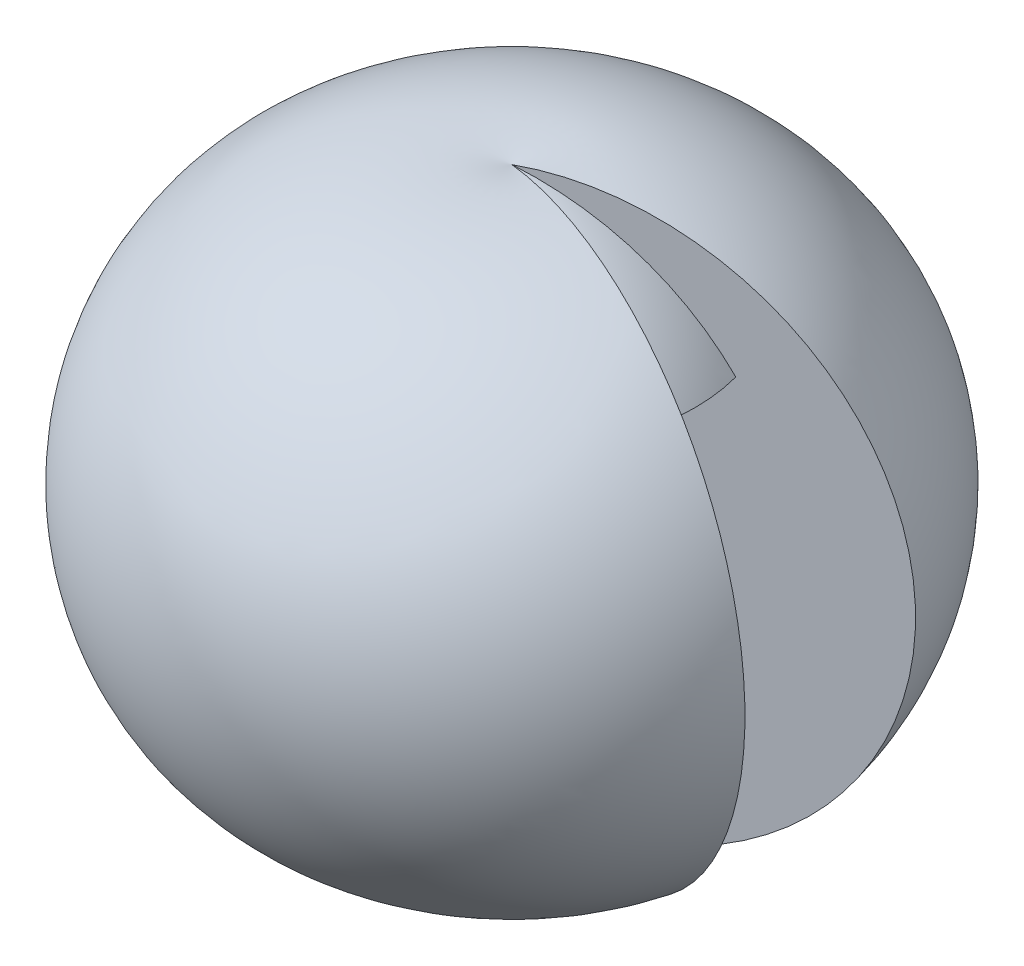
ISO-10303-21;
HEADER;
FILE_DESCRIPTION(('STEP AP214'),'2;1');
FILE_NAME('part.step','',(''),(''),'','','');
FILE_SCHEMA(('AUTOMOTIVE_DESIGN { 1 0 10303 214 1 1 1 1 }'));
ENDSEC;
DATA;
#1=APPLICATION_CONTEXT('core data for automotive mechanical design processes');
#2=APPLICATION_PROTOCOL_DEFINITION('international standard','automotive_design',2000,#1);
#3=PRODUCT_CONTEXT('',#1,'mechanical');
#4=PRODUCT('Part','Part','',(#3));
#5=PRODUCT_RELATED_PRODUCT_CATEGORY('part','',(#4));
#6=PRODUCT_DEFINITION_FORMATION('','',#4);
#7=PRODUCT_DEFINITION_CONTEXT('part definition',#1,'design');
#8=PRODUCT_DEFINITION('design','',#6,#7);
#9=PRODUCT_DEFINITION_SHAPE('','',#8);
#10=(LENGTH_UNIT() NAMED_UNIT(*) SI_UNIT(.MILLI.,.METRE.));
#11=(NAMED_UNIT(*) PLANE_ANGLE_UNIT() SI_UNIT($,.RADIAN.));
#12=(NAMED_UNIT(*) SI_UNIT($,.STERADIAN.) SOLID_ANGLE_UNIT());
#13=UNCERTAINTY_MEASURE_WITH_UNIT(LENGTH_MEASURE(1.E-05),#10,'distance_accuracy_value','');
#14=(GEOMETRIC_REPRESENTATION_CONTEXT(3) GLOBAL_UNCERTAINTY_ASSIGNED_CONTEXT((#13)) GLOBAL_UNIT_ASSIGNED_CONTEXT((#10,
#11,#12)) REPRESENTATION_CONTEXT('',''));
#15=CARTESIAN_POINT('',(0.,0.,0.));
#16=DIRECTION('',(0.,0.,1.));
#17=DIRECTION('',(1.,0.,0.));
#18=AXIS2_PLACEMENT_3D('',#15,#16,#17);
#19=CARTESIAN_POINT('',(0.,618.910362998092,255.119580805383));
#20=DIRECTION('',(-1.,0.,0.));
#21=DIRECTION('',(0.,0.,-1.));
#22=AXIS2_PLACEMENT_3D('',#19,#20,#21);
#23=CIRCLE('',#22,412.993946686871);
#24=TRIMMED_CURVE('',#23,(PARAMETER_VALUE(-0.904940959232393)),
(PARAMETER_VALUE(0.904940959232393)),.T.,.PARAMETER.);
#25=CARTESIAN_POINT('',(0.,618.910362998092,0.));
#26=DIRECTION('',(0.,-1.,0.));
#27=AXIS1_PLACEMENT('',#25,#26);
#28=SURFACE_OF_REVOLUTION('',#24,#27);
#29=CARTESIAN_POINT('',(-246.426591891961,618.910362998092,66.0298062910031));
#30=DIRECTION('',(0.258819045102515,0.,0.96592582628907));
#31=DIRECTION('',(-0.96592582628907,0.,0.258819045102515));
#32=AXIS2_PLACEMENT_3D('',#29,#30,#31);
#33=CIRCLE('',#32,412.993946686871);
#34=CARTESIAN_POINT('',(148.268958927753,678.865285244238,-39.7285478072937));
#35=VERTEX_POINT('',#34);
#36=CARTESIAN_POINT('',(0.,943.684129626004,0.));
#37=VERTEX_POINT('',#36);
#38=EDGE_CURVE('E132',#35,#37,#33,.T.);
#39=ORIENTED_EDGE('',*,*,#38,.T.);
#40=CARTESIAN_POINT('',(-246.426591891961,618.910362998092,-66.0298062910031));
#41=DIRECTION('',(-0.258819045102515,0.,0.96592582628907));
#42=DIRECTION('',(-0.96592582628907,0.,-0.258819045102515));
#43=AXIS2_PLACEMENT_3D('',#40,#41,#42);
#44=CIRCLE('',#43,412.993946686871);
#45=CARTESIAN_POINT('',(148.268958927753,678.865285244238,39.7285478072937));
#46=VERTEX_POINT('',#45);
#47=EDGE_CURVE('E148',#46,#37,#44,.T.);
#48=ORIENTED_EDGE('',*,*,#47,.F.);
#49=CARTESIAN_POINT('',(0.,678.865285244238,0.));
#50=DIRECTION('',(0.,-1.,0.));
#51=DIRECTION('',(0.,0.,-1.));
#52=AXIS2_PLACEMENT_3D('',#49,#50,#51);
#53=CIRCLE('',#52,153.499321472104);
#54=EDGE_CURVE('E43',#46,#35,#53,.T.);
#55=ORIENTED_EDGE('',*,*,#54,.T.);
#56=EDGE_LOOP('',(#39,#48,#55));
#57=FACE_BOUND('',#56,.T.);
#58=ADVANCED_FACE('F16',(#57),#28,.F.);
#59=CARTESIAN_POINT('',(0.,430.,-150.000000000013));
#60=DIRECTION('',(-1.,0.,0.));
#61=DIRECTION('',(0.,0.,-1.));
#62=AXIS2_PLACEMENT_3D('',#59,#60,#61);
#63=CIRCLE('',#62,848.643717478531);
#64=TRIMMED_CURVE('',#63,(PARAMETER_VALUE(-1.74848246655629)),
(PARAMETER_VALUE(1.74848246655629)),.T.,.PARAMETER.);
#65=CARTESIAN_POINT('',(0.,430.,0.));
#66=DIRECTION('',(0.,-1.,0.));
#67=AXIS1_PLACEMENT('',#65,#66);
#68=SURFACE_OF_REVOLUTION('',#64,#67);
#69=CARTESIAN_POINT('',(0.,-362.034461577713,0.));
#70=DIRECTION('',(0.,-1.,0.));
#71=DIRECTION('',(0.,0.,-1.));
#72=AXIS2_PLACEMENT_3D('',#69,#70,#71);
#73=CIRCLE('',#72,454.758217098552);
#74=CARTESIAN_POINT('',(439.262706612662,-362.034461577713,117.700087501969));
#75=VERTEX_POINT('',#74);
#76=CARTESIAN_POINT('',(439.262706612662,-362.034461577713,-117.700087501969));
#77=VERTEX_POINT('',#76);
#78=EDGE_CURVE('E170',#75,#77,#73,.T.);
#79=ORIENTED_EDGE('',*,*,#78,.F.);
#80=CARTESIAN_POINT('',(144.888873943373,430.,38.8228567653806));
#81=DIRECTION('',(0.258819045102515,0.,-0.96592582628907));
#82=DIRECTION('',(-0.96592582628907,0.,-0.258819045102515));
#83=AXIS2_PLACEMENT_3D('',#80,#81,#82);
#84=CIRCLE('',#83,848.643717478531);
#85=CARTESIAN_POINT('',(0.,1265.28208361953,0.));
#86=VERTEX_POINT('',#85);
#87=EDGE_CURVE('E152',#86,#75,#84,.T.);
#88=ORIENTED_EDGE('',*,*,#87,.F.);
#89=CARTESIAN_POINT('',(144.888873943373,430.,-38.8228567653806));
#90=DIRECTION('',(-0.258819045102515,0.,-0.96592582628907));
#91=DIRECTION('',(-0.96592582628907,0.,0.258819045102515));
#92=AXIS2_PLACEMENT_3D('',#89,#90,#91);
#93=CIRCLE('',#92,848.643717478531);
#94=EDGE_CURVE('E136',#86,#77,#93,.T.);
#95=ORIENTED_EDGE('',*,*,#94,.T.);
#96=EDGE_LOOP('',(#79,#88,#95));
#97=FACE_BOUND('',#96,.T.);
#98=ADVANCED_FACE('F18',(#97),#68,.T.);
#99=CARTESIAN_POINT('',(0.,-39.1466122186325,-330.517757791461));
#100=DIRECTION('',(-1.,0.,0.));
#101=DIRECTION('',(0.,0.,-1.));
#102=AXIS2_PLACEMENT_3D('',#99,#100,#101);
#103=CIRCLE('',#102,345.9656847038);
#104=TRIMMED_CURVE('',#103,(PARAMETER_VALUE(-2.84163290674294)),
(PARAMETER_VALUE(2.84163290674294)),.T.,.PARAMETER.);
#105=CARTESIAN_POINT('',(0.,-39.1466122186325,0.));
#106=DIRECTION('',(0.,-1.,0.));
#107=AXIS1_PLACEMENT('',#105,#106);
#108=SURFACE_OF_REVOLUTION('',#104,#107);
#109=CARTESIAN_POINT('',(319.255638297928,-39.1466122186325,-85.5442904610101));
#110=DIRECTION('',(-0.258819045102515,0.,-0.96592582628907));
#111=DIRECTION('',(-0.96592582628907,0.,0.258819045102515));
#112=AXIS2_PLACEMENT_3D('',#109,#110,#111);
#113=CIRCLE('',#112,345.9656847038);
#114=CARTESIAN_POINT('',(0.,-141.373158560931,0.));
#115=VERTEX_POINT('',#114);
#116=EDGE_CURVE('E140',#77,#115,#113,.T.);
#117=ORIENTED_EDGE('',*,*,#116,.T.);
#118=CARTESIAN_POINT('',(319.255638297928,-39.1466122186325,85.5442904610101));
#119=DIRECTION('',(0.258819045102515,0.,-0.96592582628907));
#120=DIRECTION('',(-0.96592582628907,0.,-0.258819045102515));
#121=AXIS2_PLACEMENT_3D('',#118,#119,#120);
#122=CIRCLE('',#121,345.9656847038);
#123=EDGE_CURVE('E156',#75,#115,#122,.T.);
#124=ORIENTED_EDGE('',*,*,#123,.F.);
#125=ORIENTED_EDGE('',*,*,#78,.T.);
#126=EDGE_LOOP('',(#117,#124,#125));
#127=FACE_BOUND('',#126,.T.);
#128=ADVANCED_FACE('F219',(#127),#108,.T.);
#129=CARTESIAN_POINT('',(0.,96.6929621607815,-123.496947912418));
#130=DIRECTION('',(-1.,0.,0.));
#131=DIRECTION('',(0.,0.,-1.));
#132=AXIS2_PLACEMENT_3D('',#129,#130,#131);
#133=CIRCLE('',#132,252.947213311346);
#134=TRIMMED_CURVE('',#133,(PARAMETER_VALUE(-2.08085917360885)),
(PARAMETER_VALUE(2.08085917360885)),.T.,.PARAMETER.);
#135=CARTESIAN_POINT('',(0.,96.6929621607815,0.));
#136=DIRECTION('',(0.,-1.,0.));
#137=AXIS1_PLACEMENT('',#135,#136);
#138=SURFACE_OF_REVOLUTION('',#134,#137);
#139=CARTESIAN_POINT('',(-119.288891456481,96.6929621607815,-31.9633621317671));
#140=DIRECTION('',(0.258819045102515,0.,-0.96592582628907));
#141=DIRECTION('',(-0.96592582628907,0.,-0.258819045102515));
#142=AXIS2_PLACEMENT_3D('',#139,#140,#141);
#143=CIRCLE('',#142,252.947213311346);
#144=CARTESIAN_POINT('',(-4.12137128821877,-126.391000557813,-1.104318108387));
#145=VERTEX_POINT('',#144);
#146=CARTESIAN_POINT('',(0.,-124.05756802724,0.));
#147=VERTEX_POINT('',#146);
#148=EDGE_CURVE('E110',#145,#147,#143,.F.);
#149=ORIENTED_EDGE('',*,*,#148,.F.);
#150=CARTESIAN_POINT('',(-1.82327538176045E-13,-126.391000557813,0.));
#151=DIRECTION('',(0.,-1.,0.));
#152=DIRECTION('',(1.,0.,0.));
#153=AXIS2_PLACEMENT_3D('',#150,#151,#152);
#154=CIRCLE('',#153,4.26675752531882);
#155=CARTESIAN_POINT('',(4.12137128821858,-126.391000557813,-1.10431810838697));
#156=VERTEX_POINT('',#155);
#157=EDGE_CURVE('E123',#145,#156,#154,.T.);
#158=ORIENTED_EDGE('',*,*,#157,.T.);
#159=CARTESIAN_POINT('',(119.288891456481,96.6929621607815,-31.9633621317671));
#160=DIRECTION('',(0.258819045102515,0.,0.96592582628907));
#161=DIRECTION('',(-0.96592582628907,0.,0.258819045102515));
#162=AXIS2_PLACEMENT_3D('',#159,#160,#161);
#163=CIRCLE('',#162,252.947213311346);
#164=CARTESIAN_POINT('',(312.476943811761,251.551275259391,-83.7279447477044));
#165=VERTEX_POINT('',#164);
#166=EDGE_CURVE('E143',#156,#165,#163,.T.);
#167=ORIENTED_EDGE('',*,*,#166,.T.);
#168=CARTESIAN_POINT('',(0.,251.551275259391,0.));
#169=DIRECTION('',(0.,-1.,0.));
#170=DIRECTION('',(0.,0.,-1.));
#171=AXIS2_PLACEMENT_3D('',#168,#169,#170);
#172=CIRCLE('',#171,323.499936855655);
#173=CARTESIAN_POINT('',(312.476943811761,251.551275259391,83.7279447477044));
#174=VERTEX_POINT('',#173);
#175=EDGE_CURVE('E167',#174,#165,#172,.T.);
#176=ORIENTED_EDGE('',*,*,#175,.F.);
#177=CARTESIAN_POINT('',(119.288891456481,96.6929621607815,31.9633621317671));
#178=DIRECTION('',(-0.258819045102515,0.,0.96592582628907));
#179=DIRECTION('',(-0.96592582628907,0.,-0.258819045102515));
#180=AXIS2_PLACEMENT_3D('',#177,#178,#179);
#181=CIRCLE('',#180,252.947213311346);
#182=CARTESIAN_POINT('',(4.1213712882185,-126.391000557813,1.10431810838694));
#183=VERTEX_POINT('',#182);
#184=EDGE_CURVE('E159',#183,#174,#181,.T.);
#185=ORIENTED_EDGE('',*,*,#184,.F.);
#186=CARTESIAN_POINT('',(-4.12137128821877,-126.391000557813,1.10431810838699));
#187=VERTEX_POINT('',#186);
#188=EDGE_CURVE('E121',#183,#187,#154,.T.);
#189=ORIENTED_EDGE('',*,*,#188,.T.);
#190=CARTESIAN_POINT('',(-119.288891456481,96.6929621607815,31.9633621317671));
#191=DIRECTION('',(-0.258819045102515,0.,-0.96592582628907));
#192=DIRECTION('',(-0.96592582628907,0.,0.258819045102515));
#193=AXIS2_PLACEMENT_3D('',#190,#191,#192);
#194=CIRCLE('',#193,252.947213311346);
#195=EDGE_CURVE('E99',#187,#147,#194,.F.);
#196=ORIENTED_EDGE('',*,*,#195,.T.);
#197=EDGE_LOOP('',(#149,#158,#167,#176,#185,#189,#196));
#198=FACE_BOUND('',#197,.T.);
#199=ADVANCED_FACE('F198',(#198),#138,.F.);
#200=CARTESIAN_POINT('',(0.,430.,0.));
#201=DIRECTION('',(0.,-1.,0.));
#202=DIRECTION('',(0.,0.,-1.));
#203=AXIS2_PLACEMENT_3D('',#200,#201,#202);
#204=DEGENERATE_TOROIDAL_SURFACE('',#203,150.000000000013,248.889886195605,.T.);
#205=CARTESIAN_POINT('',(144.888873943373,430.,38.8228567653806));
#206=DIRECTION('',(-0.258819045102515,0.,0.96592582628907));
#207=DIRECTION('',(-0.96592582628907,0.,-0.258819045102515));
#208=AXIS2_PLACEMENT_3D('',#205,#206,#207);
#209=CIRCLE('',#208,248.889886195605);
#210=EDGE_CURVE('E161',#174,#46,#209,.T.);
#211=ORIENTED_EDGE('',*,*,#210,.F.);
#212=ORIENTED_EDGE('',*,*,#175,.T.);
#213=CARTESIAN_POINT('',(144.888873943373,430.,-38.8228567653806));
#214=DIRECTION('',(0.258819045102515,0.,0.96592582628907));
#215=DIRECTION('',(-0.96592582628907,0.,0.258819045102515));
#216=AXIS2_PLACEMENT_3D('',#213,#214,#215);
#217=CIRCLE('',#216,248.889886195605);
#218=EDGE_CURVE('E145',#165,#35,#217,.T.);
#219=ORIENTED_EDGE('',*,*,#218,.T.);
#220=ORIENTED_EDGE('',*,*,#54,.F.);
#221=EDGE_LOOP('',(#211,#212,#219,#220));
#222=FACE_BOUND('',#221,.T.);
#223=ADVANCED_FACE('F193',(#222),#204,.F.);
#224=CARTESIAN_POINT('',(-246.426591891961,618.910362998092,-66.0298062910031));
#225=DIRECTION('',(0.258819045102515,0.,-0.96592582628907));
#226=DIRECTION('',(-0.96592582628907,0.,-0.258819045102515));
#227=AXIS2_PLACEMENT_3D('',#224,#225,#226);
#228=PLANE('',#227);
#229=CARTESIAN_POINT('',(-319.255638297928,-39.1466122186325,-85.5442904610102));
#230=DIRECTION('',(0.258819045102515,0.,-0.96592582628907));
#231=DIRECTION('',(-0.96592582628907,0.,-0.258819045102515));
#232=AXIS2_PLACEMENT_3D('',#229,#230,#231);
#233=CIRCLE('',#232,345.9656847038);
#234=EDGE_CURVE('E119',#183,#115,#233,.T.);
#235=ORIENTED_EDGE('',*,*,#234,.F.);
#236=ORIENTED_EDGE('',*,*,#184,.T.);
#237=ORIENTED_EDGE('',*,*,#210,.T.);
#238=ORIENTED_EDGE('',*,*,#47,.T.);
#239=CARTESIAN_POINT('',(246.42659189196,618.910362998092,66.0298062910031));
#240=DIRECTION('',(0.258819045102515,0.,-0.96592582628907));
#241=DIRECTION('',(-0.96592582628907,0.,-0.258819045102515));
#242=AXIS2_PLACEMENT_3D('',#239,#240,#241);
#243=CIRCLE('',#242,412.993946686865);
#244=CARTESIAN_POINT('',(535.060721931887,903.994516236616,143.369088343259));
#245=VERTEX_POINT('',#244);
#246=EDGE_CURVE('E130',#245,#37,#243,.F.);
#247=ORIENTED_EDGE('',*,*,#246,.F.);
#248=CARTESIAN_POINT('',(-144.888873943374,430.,-38.8228567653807));
#249=DIRECTION('',(0.258819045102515,0.,-0.96592582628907));
#250=DIRECTION('',(-0.96592582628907,0.,-0.258819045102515));
#251=AXIS2_PLACEMENT_3D('',#248,#249,#250);
#252=CIRCLE('',#251,848.643717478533);
#253=EDGE_CURVE('E127',#86,#245,#252,.T.);
#254=ORIENTED_EDGE('',*,*,#253,.F.);
#255=ORIENTED_EDGE('',*,*,#87,.T.);
#256=ORIENTED_EDGE('',*,*,#123,.T.);
#257=EDGE_LOOP('',(#235,#236,#237,#238,#247,#254,#255,#256));
#258=FACE_BOUND('',#257,.T.);
#259=ADVANCED_FACE('F189',(#258),#228,.T.);
#260=CARTESIAN_POINT('',(-246.426591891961,618.910362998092,66.0298062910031));
#261=DIRECTION('',(-0.258819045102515,0.,-0.96592582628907));
#262=DIRECTION('',(-0.96592582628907,0.,0.258819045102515));
#263=AXIS2_PLACEMENT_3D('',#260,#261,#262);
#264=PLANE('',#263);
#265=ORIENTED_EDGE('',*,*,#166,.F.);
#266=CARTESIAN_POINT('',(-319.255638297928,-39.1466122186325,85.5442904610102));
#267=DIRECTION('',(-0.258819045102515,0.,-0.96592582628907));
#268=DIRECTION('',(-0.96592582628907,0.,0.258819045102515));
#269=AXIS2_PLACEMENT_3D('',#266,#267,#268);
#270=CIRCLE('',#269,345.9656847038);
#271=EDGE_CURVE('E11',#156,#115,#270,.T.);
#272=ORIENTED_EDGE('',*,*,#271,.T.);
#273=ORIENTED_EDGE('',*,*,#116,.F.);
#274=ORIENTED_EDGE('',*,*,#94,.F.);
#275=CARTESIAN_POINT('',(-144.888873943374,430.,38.8228567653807));
#276=DIRECTION('',(-0.258819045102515,0.,-0.96592582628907));
#277=DIRECTION('',(-0.96592582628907,0.,0.258819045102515));
#278=AXIS2_PLACEMENT_3D('',#275,#276,#277);
#279=CIRCLE('',#278,848.643717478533);
#280=CARTESIAN_POINT('',(535.060721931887,903.994516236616,-143.369088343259));
#281=VERTEX_POINT('',#280);
#282=EDGE_CURVE('E172',#86,#281,#279,.T.);
#283=ORIENTED_EDGE('',*,*,#282,.T.);
#284=CARTESIAN_POINT('',(246.42659189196,618.910362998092,-66.029806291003));
#285=DIRECTION('',(-0.258819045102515,0.,-0.96592582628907));
#286=DIRECTION('',(-0.96592582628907,0.,0.258819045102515));
#287=AXIS2_PLACEMENT_3D('',#284,#285,#286);
#288=CIRCLE('',#287,412.993946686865);
#289=EDGE_CURVE('E24',#281,#37,#288,.F.);
#290=ORIENTED_EDGE('',*,*,#289,.T.);
#291=ORIENTED_EDGE('',*,*,#38,.F.);
#292=ORIENTED_EDGE('',*,*,#218,.F.);
#293=EDGE_LOOP('',(#265,#272,#273,#274,#283,#290,#291,#292));
#294=FACE_BOUND('',#293,.T.);
#295=ADVANCED_FACE('F181',(#294),#264,.F.);
#296=CARTESIAN_POINT('',(255.119580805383,618.910362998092,0.));
#297=DIRECTION('',(0.,0.,-1.));
#298=DIRECTION('',(1.,0.,0.));
#299=AXIS2_PLACEMENT_3D('',#296,#297,#298);
#300=CIRCLE('',#299,412.993946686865);
#301=TRIMMED_CURVE('',#300,(PARAMETER_VALUE(-2.23665169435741)),
(PARAMETER_VALUE(2.23665169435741)),.T.,.PARAMETER.);
#302=CARTESIAN_POINT('',(-1.11022302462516E-13,618.910362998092,0.));
#303=DIRECTION('',(0.,-1.,0.));
#304=AXIS1_PLACEMENT('',#302,#303);
#305=SURFACE_OF_REVOLUTION('',#301,#304);
#306=CARTESIAN_POINT('',(-1.38596748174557E-13,903.994516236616,0.));
#307=DIRECTION('',(0.,-1.,0.));
#308=DIRECTION('',(1.,0.,0.));
#309=AXIS2_PLACEMENT_3D('',#306,#307,#308);
#310=CIRCLE('',#309,553.935620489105);
#311=EDGE_CURVE('E34',#281,#245,#310,.T.);
#312=ORIENTED_EDGE('',*,*,#311,.T.);
#313=ORIENTED_EDGE('',*,*,#246,.T.);
#314=ORIENTED_EDGE('',*,*,#289,.F.);
#315=EDGE_LOOP('',(#312,#313,#314));
#316=FACE_BOUND('',#315,.T.);
#317=ADVANCED_FACE('F235',(#316),#305,.F.);
#318=CARTESIAN_POINT('',(-150.000000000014,430.,0.));
#319=DIRECTION('',(0.,0.,-1.));
#320=DIRECTION('',(1.,0.,0.));
#321=AXIS2_PLACEMENT_3D('',#318,#319,#320);
#322=CIRCLE('',#321,848.643717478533);
#323=TRIMMED_CURVE('',#322,(PARAMETER_VALUE(-1.3931101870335)),
(PARAMETER_VALUE(1.3931101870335)),.T.,.PARAMETER.);
#324=CARTESIAN_POINT('',(-1.11022302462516E-13,430.,0.));
#325=DIRECTION('',(0.,-1.,0.));
#326=AXIS1_PLACEMENT('',#324,#325);
#327=SURFACE_OF_REVOLUTION('',#323,#326);
#328=ORIENTED_EDGE('',*,*,#282,.F.);
#329=ORIENTED_EDGE('',*,*,#253,.T.);
#330=ORIENTED_EDGE('',*,*,#311,.F.);
#331=EDGE_LOOP('',(#328,#329,#330));
#332=FACE_BOUND('',#331,.T.);
#333=ADVANCED_FACE('F234',(#332),#327,.T.);
#334=CARTESIAN_POINT('',(319.255638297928,-39.1466122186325,-85.5442904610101));
#335=DIRECTION('',(-0.258819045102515,0.,-0.96592582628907));
#336=DIRECTION('',(-0.96592582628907,0.,0.258819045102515));
#337=AXIS2_PLACEMENT_3D('',#334,#335,#336);
#338=PLANE('',#337);
#339=ORIENTED_EDGE('',*,*,#195,.F.);
#340=CARTESIAN_POINT('',(319.255638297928,-39.1466122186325,-85.5442904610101));
#341=DIRECTION('',(-0.258819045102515,0.,-0.96592582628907));
#342=DIRECTION('',(-0.96592582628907,0.,0.258819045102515));
#343=AXIS2_PLACEMENT_3D('',#340,#341,#342);
#344=CIRCLE('',#343,345.9656847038);
#345=CARTESIAN_POINT('',(-5.48459937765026,-120.783717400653,1.46959397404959));
#346=VERTEX_POINT('',#345);
#347=EDGE_CURVE('E92',#187,#346,#344,.T.);
#348=ORIENTED_EDGE('',*,*,#347,.T.);
#349=CARTESIAN_POINT('',(119.288891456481,96.6929621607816,-31.9633621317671));
#350=DIRECTION('',(0.258819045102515,0.,0.96592582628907));
#351=DIRECTION('',(-0.96592582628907,0.,0.258819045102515));
#352=AXIS2_PLACEMENT_3D('',#349,#350,#351);
#353=CIRCLE('',#352,252.947213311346);
#354=EDGE_CURVE('E96',#346,#147,#353,.T.);
#355=ORIENTED_EDGE('',*,*,#354,.T.);
#356=EDGE_LOOP('',(#339,#348,#355));
#357=FACE_BOUND('',#356,.T.);
#358=ADVANCED_FACE('F94',(#357),#338,.T.);
#359=CARTESIAN_POINT('',(-330.517757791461,-39.1466122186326,0.));
#360=DIRECTION('',(0.,0.,-1.));
#361=DIRECTION('',(1.,0.,0.));
#362=AXIS2_PLACEMENT_3D('',#359,#360,#361);
#363=CIRCLE('',#362,345.9656847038);
#364=TRIMMED_CURVE('',#363,(PARAMETER_VALUE(-0.299959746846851)),
(PARAMETER_VALUE(0.299959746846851)),.T.,.PARAMETER.);
#365=CARTESIAN_POINT('',(-1.11022302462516E-13,-39.1466122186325,0.));
#366=DIRECTION('',(0.,-1.,0.));
#367=AXIS1_PLACEMENT('',#365,#366);
#368=SURFACE_OF_REVOLUTION('',#364,#367);
#369=ORIENTED_EDGE('',*,*,#157,.F.);
#370=CARTESIAN_POINT('',(319.255638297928,-39.1466122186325,85.5442904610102));
#371=DIRECTION('',(0.258819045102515,0.,-0.96592582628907));
#372=DIRECTION('',(-0.96592582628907,0.,-0.258819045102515));
#373=AXIS2_PLACEMENT_3D('',#370,#371,#372);
#374=CIRCLE('',#373,345.9656847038);
#375=CARTESIAN_POINT('',(-5.48459937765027,-120.783717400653,-1.46959397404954));
#376=VERTEX_POINT('',#375);
#377=EDGE_CURVE('E107',#145,#376,#374,.T.);
#378=ORIENTED_EDGE('',*,*,#377,.T.);
#379=CARTESIAN_POINT('',(0.,-120.783717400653,0.));
#380=DIRECTION('',(0.,-1.,0.));
#381=DIRECTION('',(1.,0.,0.));
#382=AXIS2_PLACEMENT_3D('',#379,#380,#381);
#383=CIRCLE('',#382,5.67807509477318);
#384=EDGE_CURVE('E104',#376,#346,#383,.T.);
#385=ORIENTED_EDGE('',*,*,#384,.T.);
#386=ORIENTED_EDGE('',*,*,#347,.F.);
#387=ORIENTED_EDGE('',*,*,#188,.F.);
#388=ORIENTED_EDGE('',*,*,#234,.T.);
#389=ORIENTED_EDGE('',*,*,#271,.F.);
#390=EDGE_LOOP('',(#369,#378,#385,#386,#387,#388,#389));
#391=FACE_BOUND('',#390,.T.);
#392=ADVANCED_FACE('F105',(#391),#368,.T.);
#393=CARTESIAN_POINT('',(319.255638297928,-39.1466122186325,85.5442904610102));
#394=DIRECTION('',(0.258819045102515,0.,-0.96592582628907));
#395=DIRECTION('',(-0.96592582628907,0.,-0.258819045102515));
#396=AXIS2_PLACEMENT_3D('',#393,#394,#395);
#397=PLANE('',#396);
#398=ORIENTED_EDGE('',*,*,#377,.F.);
#399=ORIENTED_EDGE('',*,*,#148,.T.);
#400=CARTESIAN_POINT('',(119.288891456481,96.6929621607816,31.9633621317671));
#401=DIRECTION('',(-0.258819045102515,0.,0.96592582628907));
#402=DIRECTION('',(-0.96592582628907,0.,-0.258819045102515));
#403=AXIS2_PLACEMENT_3D('',#400,#401,#402);
#404=CIRCLE('',#403,252.947213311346);
#405=EDGE_CURVE('E111',#376,#147,#404,.T.);
#406=ORIENTED_EDGE('',*,*,#405,.F.);
#407=EDGE_LOOP('',(#398,#399,#406));
#408=FACE_BOUND('',#407,.T.);
#409=ADVANCED_FACE('F200',(#408),#397,.F.);
#410=CARTESIAN_POINT('',(-123.496947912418,96.6929621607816,0.));
#411=DIRECTION('',(0.,0.,-1.));
#412=DIRECTION('',(1.,0.,0.));
#413=AXIS2_PLACEMENT_3D('',#410,#411,#412);
#414=CIRCLE('',#413,252.947213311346);
#415=TRIMMED_CURVE('',#414,(PARAMETER_VALUE(-1.06073347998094)),
(PARAMETER_VALUE(1.06073347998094)),.T.,.PARAMETER.);
#416=CARTESIAN_POINT('',(0.,96.6929621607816,0.));
#417=DIRECTION('',(0.,-1.,0.));
#418=AXIS1_PLACEMENT('',#416,#417);
#419=SURFACE_OF_REVOLUTION('',#415,#418);
#420=ORIENTED_EDGE('',*,*,#354,.F.);
#421=ORIENTED_EDGE('',*,*,#384,.F.);
#422=ORIENTED_EDGE('',*,*,#405,.T.);
#423=EDGE_LOOP('',(#420,#421,#422));
#424=FACE_BOUND('',#423,.T.);
#425=ADVANCED_FACE('F113',(#424),#419,.F.);
#426=CLOSED_SHELL('',(#58,#98,#128,#199,#223,#259,#295,#317,#333,#358,#392,#409,#425));
#427=MANIFOLD_SOLID_BREP('B1',#426);
#428=ADVANCED_BREP_SHAPE_REPRESENTATION('',(#18,#427),#14);
#429=SHAPE_DEFINITION_REPRESENTATION(#9,#428);
ENDSEC;
END-ISO-10303-21;
